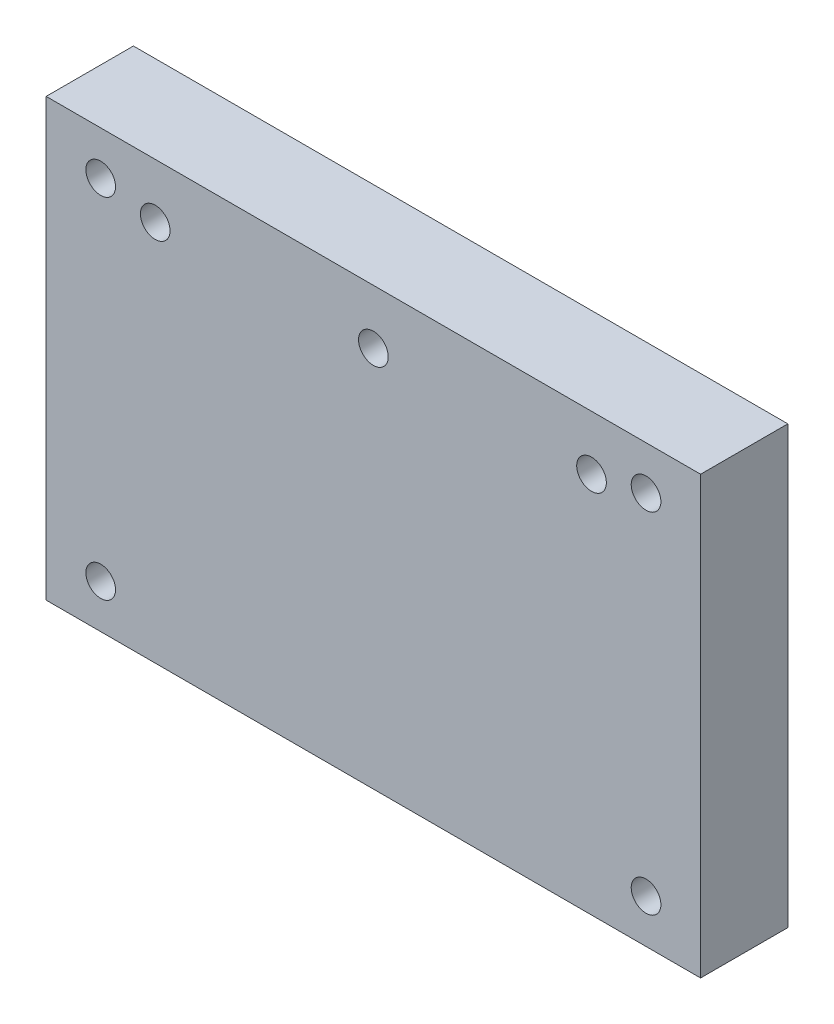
ISO-10303-21;
HEADER;
FILE_DESCRIPTION(('STEP AP214'),'2;1');
FILE_NAME('part.step','',(''),(''),'','','');
FILE_SCHEMA(('AUTOMOTIVE_DESIGN { 1 0 10303 214 1 1 1 1 }'));
ENDSEC;
DATA;
#1=APPLICATION_CONTEXT('core data for automotive mechanical design processes');
#2=APPLICATION_PROTOCOL_DEFINITION('international standard','automotive_design',2000,#1);
#3=PRODUCT_CONTEXT('',#1,'mechanical');
#4=PRODUCT('Part','Part','',(#3));
#5=PRODUCT_RELATED_PRODUCT_CATEGORY('part','',(#4));
#6=PRODUCT_DEFINITION_FORMATION('','',#4);
#7=PRODUCT_DEFINITION_CONTEXT('part definition',#1,'design');
#8=PRODUCT_DEFINITION('design','',#6,#7);
#9=PRODUCT_DEFINITION_SHAPE('','',#8);
#10=(LENGTH_UNIT() NAMED_UNIT(*) SI_UNIT(.MILLI.,.METRE.));
#11=(NAMED_UNIT(*) PLANE_ANGLE_UNIT() SI_UNIT($,.RADIAN.));
#12=(NAMED_UNIT(*) SI_UNIT($,.STERADIAN.) SOLID_ANGLE_UNIT());
#13=UNCERTAINTY_MEASURE_WITH_UNIT(LENGTH_MEASURE(1.E-05),#10,'distance_accuracy_value','');
#14=(GEOMETRIC_REPRESENTATION_CONTEXT(3) GLOBAL_UNCERTAINTY_ASSIGNED_CONTEXT((#13)) GLOBAL_UNIT_ASSIGNED_CONTEXT((#10,
#11,#12)) REPRESENTATION_CONTEXT('',''));
#15=CARTESIAN_POINT('',(0.,0.,0.));
#16=DIRECTION('',(0.,0.,1.));
#17=DIRECTION('',(1.,0.,0.));
#18=AXIS2_PLACEMENT_3D('',#15,#16,#17);
#19=CARTESIAN_POINT('',(-1.11022302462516E-13,50.,19.999999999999));
#20=DIRECTION('',(1.,0.,0.));
#21=DIRECTION('',(0.,0.,-1.));
#22=AXIS2_PLACEMENT_3D('',#19,#20,#21);
#23=PLANE('',#22);
#24=DIRECTION('',(0.,-0.999999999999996,0.));
#25=VECTOR('',#24,1.);
#26=CARTESIAN_POINT('',(0.,50.,-1.11022302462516E-13));
#27=LINE('',#26,#25);
#28=CARTESIAN_POINT('',(0.,50.,-1.11022302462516E-13));
#29=VERTEX_POINT('',#28);
#30=CARTESIAN_POINT('',(0.,-50.,0.));
#31=VERTEX_POINT('',#30);
#32=EDGE_CURVE('E89',#29,#31,#27,.T.);
#33=ORIENTED_EDGE('',*,*,#32,.T.);
#34=DIRECTION('',(0.,0.,-1.));
#35=VECTOR('',#34,1.);
#36=CARTESIAN_POINT('',(0.,-50.,19.9999999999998));
#37=LINE('',#36,#35);
#38=CARTESIAN_POINT('',(0.,-50.,19.9999999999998));
#39=VERTEX_POINT('',#38);
#40=EDGE_CURVE('E11',#39,#31,#37,.T.);
#41=ORIENTED_EDGE('',*,*,#40,.F.);
#42=DIRECTION('',(0.,-0.999999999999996,0.));
#43=VECTOR('',#42,1.);
#44=CARTESIAN_POINT('',(-1.11022302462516E-13,50.,19.999999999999));
#45=LINE('',#44,#43);
#46=CARTESIAN_POINT('',(-1.11022302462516E-13,50.,19.999999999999));
#47=VERTEX_POINT('',#46);
#48=EDGE_CURVE('E119',#47,#39,#45,.T.);
#49=ORIENTED_EDGE('',*,*,#48,.F.);
#50=DIRECTION('',(0.,0.,-1.));
#51=VECTOR('',#50,1.);
#52=CARTESIAN_POINT('',(-1.11022302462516E-13,50.,19.999999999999));
#53=LINE('',#52,#51);
#54=EDGE_CURVE('E102',#47,#29,#53,.T.);
#55=ORIENTED_EDGE('',*,*,#54,.T.);
#56=EDGE_LOOP('',(#33,#41,#49,#55));
#57=FACE_BOUND('',#56,.T.);
#58=ADVANCED_FACE('F44',(#57),#23,.F.);
#59=CARTESIAN_POINT('',(0.,-50.,19.9999999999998));
#60=DIRECTION('',(0.,0.999999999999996,0.));
#61=DIRECTION('',(0.,0.,1.));
#62=AXIS2_PLACEMENT_3D('',#59,#60,#61);
#63=PLANE('',#62);
#64=DIRECTION('',(1.,0.,0.));
#65=VECTOR('',#64,1.);
#66=CARTESIAN_POINT('',(0.,-50.,0.));
#67=LINE('',#66,#65);
#68=CARTESIAN_POINT('',(150.,-50.,-1.66533453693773E-13));
#69=VERTEX_POINT('',#68);
#70=EDGE_CURVE('E85',#31,#69,#67,.T.);
#71=ORIENTED_EDGE('',*,*,#70,.T.);
#72=DIRECTION('',(0.,0.,-1.));
#73=VECTOR('',#72,1.);
#74=CARTESIAN_POINT('',(150.,-50.,20.));
#75=LINE('',#74,#73);
#76=CARTESIAN_POINT('',(150.,-50.,20.));
#77=VERTEX_POINT('',#76);
#78=EDGE_CURVE('E52',#77,#69,#75,.T.);
#79=ORIENTED_EDGE('',*,*,#78,.F.);
#80=DIRECTION('',(1.,0.,0.));
#81=VECTOR('',#80,1.);
#82=CARTESIAN_POINT('',(0.,-50.,19.9999999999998));
#83=LINE('',#82,#81);
#84=EDGE_CURVE('E98',#39,#77,#83,.T.);
#85=ORIENTED_EDGE('',*,*,#84,.F.);
#86=ORIENTED_EDGE('',*,*,#40,.T.);
#87=EDGE_LOOP('',(#71,#79,#85,#86));
#88=FACE_BOUND('',#87,.T.);
#89=ADVANCED_FACE('F97',(#88),#63,.F.);
#90=CARTESIAN_POINT('',(150.,49.9999999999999,19.9999999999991));
#91=DIRECTION('',(-1.,0.,0.));
#92=DIRECTION('',(0.,0.,1.));
#93=AXIS2_PLACEMENT_3D('',#90,#91,#92);
#94=PLANE('',#93);
#95=DIRECTION('',(0.,0.999999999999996,0.));
#96=VECTOR('',#95,1.);
#97=CARTESIAN_POINT('',(150.,49.9999999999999,-1.66533453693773E-13));
#98=LINE('',#97,#96);
#99=CARTESIAN_POINT('',(150.,49.9999999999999,-1.66533453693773E-13));
#100=VERTEX_POINT('',#99);
#101=EDGE_CURVE('E90',#69,#100,#98,.T.);
#102=ORIENTED_EDGE('',*,*,#101,.T.);
#103=DIRECTION('',(0.,0.,-1.));
#104=VECTOR('',#103,1.);
#105=CARTESIAN_POINT('',(150.,49.9999999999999,19.9999999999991));
#106=LINE('',#105,#104);
#107=CARTESIAN_POINT('',(150.,49.9999999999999,19.9999999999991));
#108=VERTEX_POINT('',#107);
#109=EDGE_CURVE('E130',#108,#100,#106,.T.);
#110=ORIENTED_EDGE('',*,*,#109,.F.);
#111=DIRECTION('',(0.,0.999999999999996,0.));
#112=VECTOR('',#111,1.);
#113=CARTESIAN_POINT('',(150.,49.9999999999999,19.9999999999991));
#114=LINE('',#113,#112);
#115=EDGE_CURVE('E64',#77,#108,#114,.T.);
#116=ORIENTED_EDGE('',*,*,#115,.F.);
#117=ORIENTED_EDGE('',*,*,#78,.T.);
#118=EDGE_LOOP('',(#102,#110,#116,#117));
#119=FACE_BOUND('',#118,.T.);
#120=ADVANCED_FACE('F137',(#119),#94,.F.);
#121=CARTESIAN_POINT('',(-1.11022302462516E-13,50.,19.999999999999));
#122=DIRECTION('',(0.,-0.999999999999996,0.));
#123=DIRECTION('',(0.,0.,-1.));
#124=AXIS2_PLACEMENT_3D('',#121,#122,#123);
#125=PLANE('',#124);
#126=DIRECTION('',(-1.,0.,0.));
#127=VECTOR('',#126,1.);
#128=CARTESIAN_POINT('',(0.,50.,-1.11022302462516E-13));
#129=LINE('',#128,#127);
#130=EDGE_CURVE('E116',#100,#29,#129,.T.);
#131=ORIENTED_EDGE('',*,*,#130,.T.);
#132=ORIENTED_EDGE('',*,*,#54,.F.);
#133=DIRECTION('',(-1.,0.,0.));
#134=VECTOR('',#133,1.);
#135=CARTESIAN_POINT('',(-1.11022302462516E-13,50.,19.999999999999));
#136=LINE('',#135,#134);
#137=EDGE_CURVE('E59',#108,#47,#136,.T.);
#138=ORIENTED_EDGE('',*,*,#137,.F.);
#139=ORIENTED_EDGE('',*,*,#109,.T.);
#140=EDGE_LOOP('',(#131,#132,#138,#139));
#141=FACE_BOUND('',#140,.T.);
#142=ADVANCED_FACE('F139',(#141),#125,.F.);
#143=CARTESIAN_POINT('',(0.,-50.,19.9999999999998));
#144=DIRECTION('',(0.,0.,1.));
#145=DIRECTION('',(1.,0.,0.));
#146=AXIS2_PLACEMENT_3D('',#143,#144,#145);
#147=PLANE('',#146);
#148=CARTESIAN_POINT('',(75.,37.5,19.999999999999));
#149=DIRECTION('',(0.,0.,1.));
#150=DIRECTION('',(1.,0.,0.));
#151=AXIS2_PLACEMENT_3D('',#148,#149,#150);
#152=CIRCLE('',#151,3.4);
#153=CARTESIAN_POINT('',(78.3999999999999,37.5,19.999999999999));
#154=VERTEX_POINT('',#153);
#155=EDGE_CURVE('E293',#154,#154,#152,.T.);
#156=ORIENTED_EDGE('',*,*,#155,.F.);
#157=EDGE_LOOP('',(#156));
#158=FACE_BOUND('',#157,.T.);
#159=CARTESIAN_POINT('',(125.,37.4999999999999,19.999999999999));
#160=DIRECTION('',(0.,0.,1.));
#161=DIRECTION('',(1.,0.,0.));
#162=AXIS2_PLACEMENT_3D('',#159,#160,#161);
#163=CIRCLE('',#162,3.39999999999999);
#164=CARTESIAN_POINT('',(128.4,37.4999999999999,19.999999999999));
#165=VERTEX_POINT('',#164);
#166=EDGE_CURVE('E300',#165,#165,#163,.T.);
#167=ORIENTED_EDGE('',*,*,#166,.F.);
#168=EDGE_LOOP('',(#167));
#169=FACE_BOUND('',#168,.T.);
#170=CARTESIAN_POINT('',(25.,37.5,19.999999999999));
#171=DIRECTION('',(0.,0.,1.));
#172=DIRECTION('',(1.,0.,0.));
#173=AXIS2_PLACEMENT_3D('',#170,#171,#172);
#174=CIRCLE('',#173,3.4);
#175=CARTESIAN_POINT('',(28.4,37.5,19.999999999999));
#176=VERTEX_POINT('',#175);
#177=EDGE_CURVE('E311',#176,#176,#174,.T.);
#178=ORIENTED_EDGE('',*,*,#177,.F.);
#179=EDGE_LOOP('',(#178));
#180=FACE_BOUND('',#179,.T.);
#181=CARTESIAN_POINT('',(12.5,40.,19.9999999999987));
#182=DIRECTION('',(0.,0.,1.));
#183=DIRECTION('',(1.,0.,0.));
#184=AXIS2_PLACEMENT_3D('',#181,#182,#183);
#185=CIRCLE('',#184,3.39999999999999);
#186=CARTESIAN_POINT('',(15.9,40.,19.9999999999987));
#187=VERTEX_POINT('',#186);
#188=EDGE_CURVE('E318',#187,#187,#185,.T.);
#189=ORIENTED_EDGE('',*,*,#188,.F.);
#190=EDGE_LOOP('',(#189));
#191=FACE_BOUND('',#190,.T.);
#192=CARTESIAN_POINT('',(137.5,39.9999999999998,19.9999999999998));
#193=DIRECTION('',(0.,0.,1.));
#194=DIRECTION('',(1.,0.,0.));
#195=AXIS2_PLACEMENT_3D('',#192,#193,#194);
#196=CIRCLE('',#195,3.39999999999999);
#197=CARTESIAN_POINT('',(140.9,39.9999999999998,19.9999999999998));
#198=VERTEX_POINT('',#197);
#199=EDGE_CURVE('E326',#198,#198,#196,.T.);
#200=ORIENTED_EDGE('',*,*,#199,.F.);
#201=EDGE_LOOP('',(#200));
#202=FACE_BOUND('',#201,.T.);
#203=CARTESIAN_POINT('',(137.5,-39.9999999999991,19.9999999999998));
#204=DIRECTION('',(0.,0.,1.));
#205=DIRECTION('',(1.,0.,0.));
#206=AXIS2_PLACEMENT_3D('',#203,#204,#205);
#207=CIRCLE('',#206,3.39999999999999);
#208=CARTESIAN_POINT('',(140.9,-39.9999999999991,19.9999999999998));
#209=VERTEX_POINT('',#208);
#210=EDGE_CURVE('E332',#209,#209,#207,.T.);
#211=ORIENTED_EDGE('',*,*,#210,.F.);
#212=EDGE_LOOP('',(#211));
#213=FACE_BOUND('',#212,.T.);
#214=CARTESIAN_POINT('',(12.5,-40.,19.9999999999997));
#215=DIRECTION('',(0.,0.,1.));
#216=DIRECTION('',(1.,0.,0.));
#217=AXIS2_PLACEMENT_3D('',#214,#215,#216);
#218=CIRCLE('',#217,3.39999999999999);
#219=CARTESIAN_POINT('',(15.9,-40.,19.9999999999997));
#220=VERTEX_POINT('',#219);
#221=EDGE_CURVE('E104',#220,#220,#218,.T.);
#222=ORIENTED_EDGE('',*,*,#221,.F.);
#223=EDGE_LOOP('',(#222));
#224=FACE_BOUND('',#223,.T.);
#225=ORIENTED_EDGE('',*,*,#48,.T.);
#226=ORIENTED_EDGE('',*,*,#84,.T.);
#227=ORIENTED_EDGE('',*,*,#115,.T.);
#228=ORIENTED_EDGE('',*,*,#137,.T.);
#229=EDGE_LOOP('',(#225,#226,#227,#228));
#230=FACE_BOUND('',#229,.T.);
#231=ADVANCED_FACE('F140',(#158,#169,#180,#191,#202,#213,#224,#230),#147,.T.);
#232=CARTESIAN_POINT('',(0.,-50.,0.));
#233=DIRECTION('',(0.,0.,1.));
#234=DIRECTION('',(1.,0.,0.));
#235=AXIS2_PLACEMENT_3D('',#232,#233,#234);
#236=PLANE('',#235);
#237=CARTESIAN_POINT('',(75.,37.5,0.));
#238=DIRECTION('',(0.,0.,1.));
#239=DIRECTION('',(1.,0.,0.));
#240=AXIS2_PLACEMENT_3D('',#237,#238,#239);
#241=CIRCLE('',#240,3.4);
#242=CARTESIAN_POINT('',(78.3999999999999,37.5,0.));
#243=VERTEX_POINT('',#242);
#244=EDGE_CURVE('E291',#243,#243,#241,.T.);
#245=ORIENTED_EDGE('',*,*,#244,.T.);
#246=EDGE_LOOP('',(#245));
#247=FACE_BOUND('',#246,.T.);
#248=CARTESIAN_POINT('',(125.,37.4999999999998,-1.66533453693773E-13));
#249=DIRECTION('',(0.,0.,1.));
#250=DIRECTION('',(1.,0.,0.));
#251=AXIS2_PLACEMENT_3D('',#248,#249,#250);
#252=CIRCLE('',#251,3.39999999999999);
#253=CARTESIAN_POINT('',(128.4,37.4999999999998,-1.66533453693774E-13));
#254=VERTEX_POINT('',#253);
#255=EDGE_CURVE('E295',#254,#254,#252,.T.);
#256=ORIENTED_EDGE('',*,*,#255,.T.);
#257=EDGE_LOOP('',(#256));
#258=FACE_BOUND('',#257,.T.);
#259=CARTESIAN_POINT('',(24.9999999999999,37.5,-1.11022302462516E-13));
#260=DIRECTION('',(0.,0.,1.));
#261=DIRECTION('',(1.,0.,0.));
#262=AXIS2_PLACEMENT_3D('',#259,#260,#261);
#263=CIRCLE('',#262,3.39999999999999);
#264=CARTESIAN_POINT('',(28.3999999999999,37.5,-1.11022302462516E-13));
#265=VERTEX_POINT('',#264);
#266=EDGE_CURVE('E307',#265,#265,#263,.T.);
#267=ORIENTED_EDGE('',*,*,#266,.T.);
#268=EDGE_LOOP('',(#267));
#269=FACE_BOUND('',#268,.T.);
#270=CARTESIAN_POINT('',(12.5,40.,0.));
#271=DIRECTION('',(0.,0.,1.));
#272=DIRECTION('',(1.,0.,0.));
#273=AXIS2_PLACEMENT_3D('',#270,#271,#272);
#274=CIRCLE('',#273,3.4);
#275=CARTESIAN_POINT('',(15.9,40.,0.));
#276=VERTEX_POINT('',#275);
#277=EDGE_CURVE('E315',#276,#276,#274,.T.);
#278=ORIENTED_EDGE('',*,*,#277,.T.);
#279=EDGE_LOOP('',(#278));
#280=FACE_BOUND('',#279,.T.);
#281=CARTESIAN_POINT('',(137.5,39.9999999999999,0.));
#282=DIRECTION('',(0.,0.,1.));
#283=DIRECTION('',(1.,0.,0.));
#284=AXIS2_PLACEMENT_3D('',#281,#282,#283);
#285=CIRCLE('',#284,3.39999999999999);
#286=CARTESIAN_POINT('',(140.9,39.9999999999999,0.));
#287=VERTEX_POINT('',#286);
#288=EDGE_CURVE('E322',#287,#287,#285,.T.);
#289=ORIENTED_EDGE('',*,*,#288,.T.);
#290=EDGE_LOOP('',(#289));
#291=FACE_BOUND('',#290,.T.);
#292=CARTESIAN_POINT('',(137.5,-39.9999999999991,0.));
#293=DIRECTION('',(0.,0.,1.));
#294=DIRECTION('',(1.,0.,0.));
#295=AXIS2_PLACEMENT_3D('',#292,#293,#294);
#296=CIRCLE('',#295,3.39999999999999);
#297=CARTESIAN_POINT('',(140.9,-39.9999999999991,0.));
#298=VERTEX_POINT('',#297);
#299=EDGE_CURVE('E329',#298,#298,#296,.T.);
#300=ORIENTED_EDGE('',*,*,#299,.T.);
#301=EDGE_LOOP('',(#300));
#302=FACE_BOUND('',#301,.T.);
#303=CARTESIAN_POINT('',(12.5,-40.,0.));
#304=DIRECTION('',(0.,0.,1.));
#305=DIRECTION('',(1.,0.,0.));
#306=AXIS2_PLACEMENT_3D('',#303,#304,#305);
#307=CIRCLE('',#306,3.4);
#308=CARTESIAN_POINT('',(15.9,-40.,0.));
#309=VERTEX_POINT('',#308);
#310=EDGE_CURVE('E110',#309,#309,#307,.T.);
#311=ORIENTED_EDGE('',*,*,#310,.T.);
#312=EDGE_LOOP('',(#311));
#313=FACE_BOUND('',#312,.T.);
#314=ORIENTED_EDGE('',*,*,#32,.F.);
#315=ORIENTED_EDGE('',*,*,#130,.F.);
#316=ORIENTED_EDGE('',*,*,#101,.F.);
#317=ORIENTED_EDGE('',*,*,#70,.F.);
#318=EDGE_LOOP('',(#314,#315,#316,#317));
#319=FACE_BOUND('',#318,.T.);
#320=ADVANCED_FACE('F86',(#247,#258,#269,#280,#291,#302,#313,#319),#236,.F.);
#321=CARTESIAN_POINT('',(12.5,-40.,19.9999999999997));
#322=DIRECTION('',(0.,0.,1.));
#323=DIRECTION('',(1.,0.,0.));
#324=AXIS2_PLACEMENT_3D('',#321,#322,#323);
#325=CYLINDRICAL_SURFACE('',#324,3.39999999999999);
#326=ORIENTED_EDGE('',*,*,#310,.F.);
#327=EDGE_LOOP('',(#326));
#328=FACE_BOUND('',#327,.T.);
#329=ORIENTED_EDGE('',*,*,#221,.T.);
#330=EDGE_LOOP('',(#329));
#331=FACE_BOUND('',#330,.T.);
#332=ADVANCED_FACE('F148',(#328,#331),#325,.F.);
#333=CARTESIAN_POINT('',(137.5,-39.9999999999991,19.9999999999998));
#334=DIRECTION('',(0.,0.,1.));
#335=DIRECTION('',(1.,0.,0.));
#336=AXIS2_PLACEMENT_3D('',#333,#334,#335);
#337=CYLINDRICAL_SURFACE('',#336,3.39999999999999);
#338=ORIENTED_EDGE('',*,*,#299,.F.);
#339=EDGE_LOOP('',(#338));
#340=FACE_BOUND('',#339,.T.);
#341=ORIENTED_EDGE('',*,*,#210,.T.);
#342=EDGE_LOOP('',(#341));
#343=FACE_BOUND('',#342,.T.);
#344=ADVANCED_FACE('F185',(#340,#343),#337,.F.);
#345=CARTESIAN_POINT('',(137.5,39.9999999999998,19.9999999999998));
#346=DIRECTION('',(0.,0.,1.));
#347=DIRECTION('',(1.,0.,0.));
#348=AXIS2_PLACEMENT_3D('',#345,#346,#347);
#349=CYLINDRICAL_SURFACE('',#348,3.39999999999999);
#350=ORIENTED_EDGE('',*,*,#288,.F.);
#351=EDGE_LOOP('',(#350));
#352=FACE_BOUND('',#351,.T.);
#353=ORIENTED_EDGE('',*,*,#199,.T.);
#354=EDGE_LOOP('',(#353));
#355=FACE_BOUND('',#354,.T.);
#356=ADVANCED_FACE('F195',(#352,#355),#349,.F.);
#357=CARTESIAN_POINT('',(12.5,40.,19.9999999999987));
#358=DIRECTION('',(0.,0.,1.));
#359=DIRECTION('',(1.,0.,0.));
#360=AXIS2_PLACEMENT_3D('',#357,#358,#359);
#361=CYLINDRICAL_SURFACE('',#360,3.39999999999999);
#362=ORIENTED_EDGE('',*,*,#277,.F.);
#363=EDGE_LOOP('',(#362));
#364=FACE_BOUND('',#363,.T.);
#365=ORIENTED_EDGE('',*,*,#188,.T.);
#366=EDGE_LOOP('',(#365));
#367=FACE_BOUND('',#366,.T.);
#368=ADVANCED_FACE('F205',(#364,#367),#361,.F.);
#369=CARTESIAN_POINT('',(25.,37.5,19.999999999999));
#370=DIRECTION('',(0.,0.,1.));
#371=DIRECTION('',(1.,0.,0.));
#372=AXIS2_PLACEMENT_3D('',#369,#370,#371);
#373=CYLINDRICAL_SURFACE('',#372,3.4);
#374=ORIENTED_EDGE('',*,*,#266,.F.);
#375=EDGE_LOOP('',(#374));
#376=FACE_BOUND('',#375,.T.);
#377=ORIENTED_EDGE('',*,*,#177,.T.);
#378=EDGE_LOOP('',(#377));
#379=FACE_BOUND('',#378,.T.);
#380=ADVANCED_FACE('F215',(#376,#379),#373,.F.);
#381=CARTESIAN_POINT('',(125.,37.4999999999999,19.999999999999));
#382=DIRECTION('',(0.,0.,1.));
#383=DIRECTION('',(1.,0.,0.));
#384=AXIS2_PLACEMENT_3D('',#381,#382,#383);
#385=CYLINDRICAL_SURFACE('',#384,3.39999999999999);
#386=ORIENTED_EDGE('',*,*,#255,.F.);
#387=EDGE_LOOP('',(#386));
#388=FACE_BOUND('',#387,.T.);
#389=ORIENTED_EDGE('',*,*,#166,.T.);
#390=EDGE_LOOP('',(#389));
#391=FACE_BOUND('',#390,.T.);
#392=ADVANCED_FACE('F225',(#388,#391),#385,.F.);
#393=CARTESIAN_POINT('',(75.,37.5,19.999999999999));
#394=DIRECTION('',(0.,0.,1.));
#395=DIRECTION('',(1.,0.,0.));
#396=AXIS2_PLACEMENT_3D('',#393,#394,#395);
#397=CYLINDRICAL_SURFACE('',#396,3.4);
#398=ORIENTED_EDGE('',*,*,#244,.F.);
#399=EDGE_LOOP('',(#398));
#400=FACE_BOUND('',#399,.T.);
#401=ORIENTED_EDGE('',*,*,#155,.T.);
#402=EDGE_LOOP('',(#401));
#403=FACE_BOUND('',#402,.T.);
#404=ADVANCED_FACE('F235',(#400,#403),#397,.F.);
#405=CLOSED_SHELL('',(#58,#89,#120,#142,#231,#320,#332,#344,#356,#368,#380,#392,#404));
#406=MANIFOLD_SOLID_BREP('B2',#405);
#407=ADVANCED_BREP_SHAPE_REPRESENTATION('',(#18,#406),#14);
#408=SHAPE_DEFINITION_REPRESENTATION(#9,#407);
ENDSEC;
END-ISO-10303-21;
